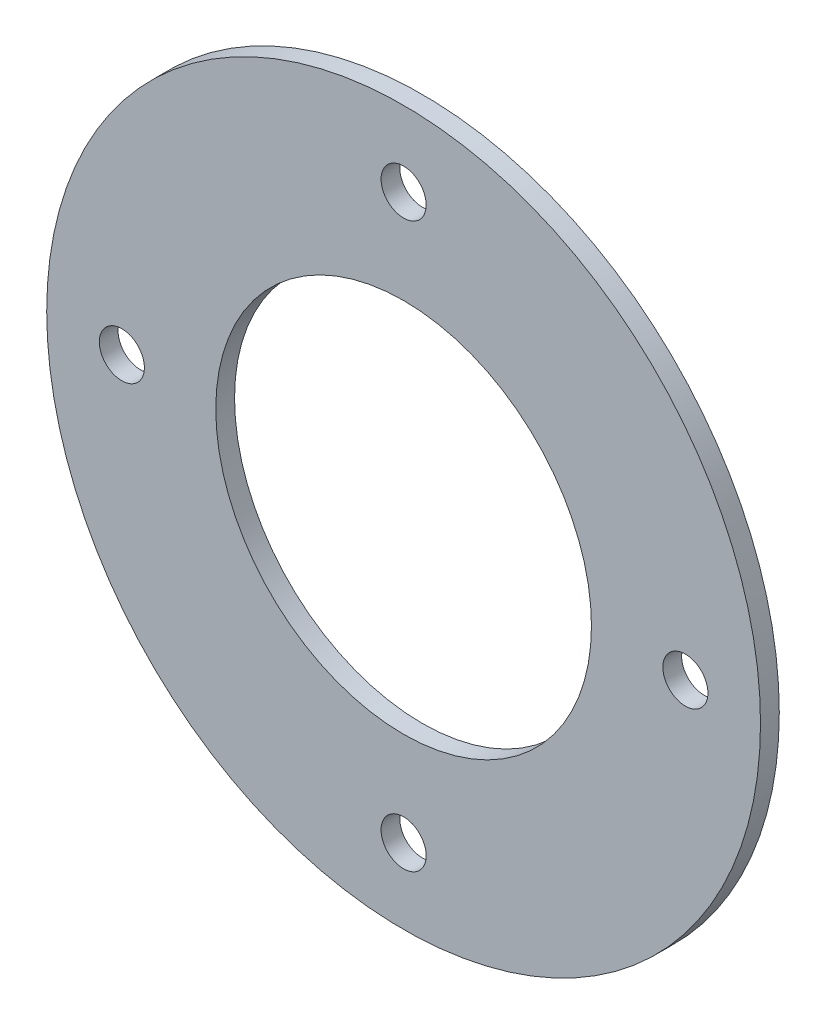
from build123d import *

# Parameters (mm, degrees)
ESQUISSE1_R                  = 95
ESQUISSE1_R_2                = 50
EXTRUSION1_DEPTH             = 5
ESQUISSE2_R                  = 6
ENL_V_MAT_EXTRU_1_DEPTH      = 135.443296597
R_P_TITION_CIRCULAIRE1_COUNT = 4


with BuildPart() as part:
    # Esquisse1 → Extrusion1 (new body)
    with BuildSketch(Plane.XY):
        Circle(ESQUISSE1_R)
        Circle(ESQUISSE1_R_2, mode=Mode.SUBTRACT)
    extrude(amount=EXTRUSION1_DEPTH)

    # Esquisse2 → Enl_v. mat.-Extru.1 (cut, through all)
    with BuildSketch(Plane(origin=(0, 0, 0), x_dir=(-1, 0, 0), z_dir=(0, 0, -1))):
        with Locations((0, -75)):
            Circle(ESQUISSE2_R)
    enl_v_mat_extru_1 = extrude(amount=-ENL_V_MAT_EXTRU_1_DEPTH, mode=Mode.SUBTRACT)

    # R_p_tition circulaire1: Enl_v. mat.-Extru.1 ×4 about axis
    r_p_tition_circulaire1_axis = Axis((0, 0, 0), (0, 0, 1))
    for i in range(1, R_P_TITION_CIRCULAIRE1_COUNT):
        add(enl_v_mat_extru_1.rotate(r_p_tition_circulaire1_axis, i * 360 / R_P_TITION_CIRCULAIRE1_COUNT), mode=Mode.SUBTRACT)


solid = part.part
